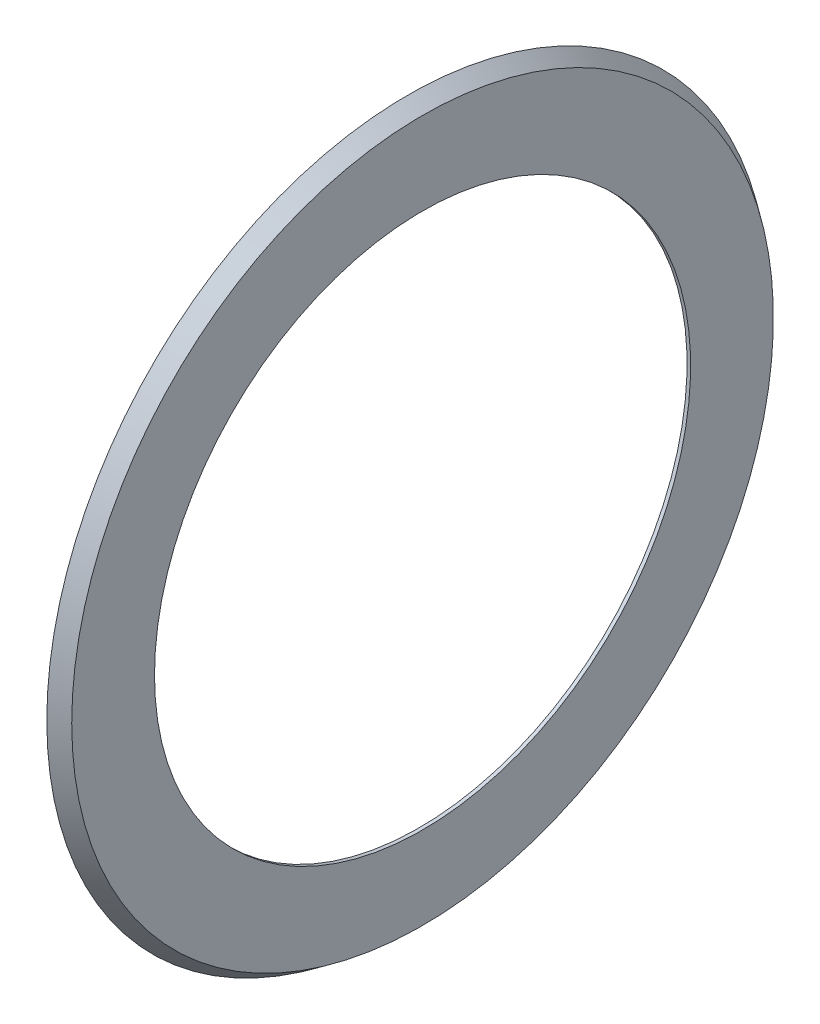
ISO-10303-21;
HEADER;
FILE_DESCRIPTION(('STEP AP214'),'2;1');
FILE_NAME('part.step','',(''),(''),'','','');
FILE_SCHEMA(('AUTOMOTIVE_DESIGN { 1 0 10303 214 1 1 1 1 }'));
ENDSEC;
DATA;
#1=APPLICATION_CONTEXT('core data for automotive mechanical design processes');
#2=APPLICATION_PROTOCOL_DEFINITION('international standard','automotive_design',2000,#1);
#3=PRODUCT_CONTEXT('',#1,'mechanical');
#4=PRODUCT('Part','Part','',(#3));
#5=PRODUCT_RELATED_PRODUCT_CATEGORY('part','',(#4));
#6=PRODUCT_DEFINITION_FORMATION('','',#4);
#7=PRODUCT_DEFINITION_CONTEXT('part definition',#1,'design');
#8=PRODUCT_DEFINITION('design','',#6,#7);
#9=PRODUCT_DEFINITION_SHAPE('','',#8);
#10=(LENGTH_UNIT() NAMED_UNIT(*) SI_UNIT(.MILLI.,.METRE.));
#11=(NAMED_UNIT(*) PLANE_ANGLE_UNIT() SI_UNIT($,.RADIAN.));
#12=(NAMED_UNIT(*) SI_UNIT($,.STERADIAN.) SOLID_ANGLE_UNIT());
#13=UNCERTAINTY_MEASURE_WITH_UNIT(LENGTH_MEASURE(1.E-05),#10,'distance_accuracy_value','');
#14=(GEOMETRIC_REPRESENTATION_CONTEXT(3) GLOBAL_UNCERTAINTY_ASSIGNED_CONTEXT((#13)) GLOBAL_UNIT_ASSIGNED_CONTEXT((#10,
#11,#12)) REPRESENTATION_CONTEXT('',''));
#15=CARTESIAN_POINT('',(0.,0.,0.));
#16=DIRECTION('',(0.,0.,1.));
#17=DIRECTION('',(1.,0.,0.));
#18=AXIS2_PLACEMENT_3D('',#15,#16,#17);
#19=CARTESIAN_POINT('',(9.38451527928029,0.,0.));
#20=DIRECTION('',(1.,0.,0.));
#21=DIRECTION('',(0.,0.,-1.));
#22=AXIS2_PLACEMENT_3D('',#19,#20,#21);
#23=CONICAL_SURFACE('',#22,15.16,1.0471975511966);
#24=CARTESIAN_POINT('',(9.,0.,0.));
#25=DIRECTION('',(-1.,0.,0.));
#26=DIRECTION('',(0.,0.,1.));
#27=AXIS2_PLACEMENT_3D('',#24,#25,#26);
#28=CIRCLE('',#27,14.494);
#29=CARTESIAN_POINT('',(9.,0.,14.494));
#30=VERTEX_POINT('',#29);
#31=EDGE_CURVE('E10',#30,#30,#28,.T.);
#32=ORIENTED_EDGE('',*,*,#31,.F.);
#33=EDGE_LOOP('',(#32));
#34=FACE_BOUND('',#33,.T.);
#35=CARTESIAN_POINT('',(9.38451527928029,0.,0.));
#36=DIRECTION('',(-1.,0.,0.));
#37=DIRECTION('',(0.,0.,1.));
#38=AXIS2_PLACEMENT_3D('',#35,#36,#37);
#39=CIRCLE('',#38,15.16);
#40=CARTESIAN_POINT('',(9.38451527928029,0.,15.16));
#41=VERTEX_POINT('',#40);
#42=EDGE_CURVE('E54',#41,#41,#39,.T.);
#43=ORIENTED_EDGE('',*,*,#42,.T.);
#44=EDGE_LOOP('',(#43));
#45=FACE_BOUND('',#44,.T.);
#46=ADVANCED_FACE('F32',(#34,#45),#23,.T.);
#47=CARTESIAN_POINT('',(9.,0.,0.));
#48=DIRECTION('',(-1.,0.,0.));
#49=DIRECTION('',(0.,0.,1.));
#50=AXIS2_PLACEMENT_3D('',#47,#48,#49);
#51=CONICAL_SURFACE('',#50,14.494,0.610865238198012);
#52=CARTESIAN_POINT('',(9.85,0.,0.));
#53=DIRECTION('',(-1.,0.,0.));
#54=DIRECTION('',(0.,0.,1.));
#55=AXIS2_PLACEMENT_3D('',#52,#53,#54);
#56=CIRCLE('',#55,13.8988235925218);
#57=CARTESIAN_POINT('',(9.85,0.,13.8988235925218));
#58=VERTEX_POINT('',#57);
#59=EDGE_CURVE('E38',#58,#58,#56,.T.);
#60=ORIENTED_EDGE('',*,*,#59,.F.);
#61=EDGE_LOOP('',(#60));
#62=FACE_BOUND('',#61,.T.);
#63=ORIENTED_EDGE('',*,*,#31,.T.);
#64=EDGE_LOOP('',(#63));
#65=FACE_BOUND('',#64,.T.);
#66=ADVANCED_FACE('F79',(#62,#65),#51,.F.);
#67=CARTESIAN_POINT('',(9.85,13.8988235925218,0.));
#68=DIRECTION('',(1.,0.,0.));
#69=DIRECTION('',(0.,0.,-1.));
#70=AXIS2_PLACEMENT_3D('',#67,#68,#69);
#71=PLANE('',#70);
#72=CARTESIAN_POINT('',(9.85,0.,0.));
#73=DIRECTION('',(-1.,0.,0.));
#74=DIRECTION('',(0.,0.,1.));
#75=AXIS2_PLACEMENT_3D('',#72,#73,#74);
#76=CIRCLE('',#75,11.254);
#77=CARTESIAN_POINT('',(9.85,0.,11.254));
#78=VERTEX_POINT('',#77);
#79=EDGE_CURVE('E42',#78,#78,#76,.T.);
#80=ORIENTED_EDGE('',*,*,#79,.F.);
#81=EDGE_LOOP('',(#80));
#82=FACE_BOUND('',#81,.T.);
#83=ORIENTED_EDGE('',*,*,#59,.T.);
#84=EDGE_LOOP('',(#83));
#85=FACE_BOUND('',#84,.T.);
#86=ADVANCED_FACE('F74',(#82,#85),#71,.F.);
#87=CARTESIAN_POINT('',(10.,0.,0.));
#88=DIRECTION('',(-1.,0.,0.));
#89=DIRECTION('',(0.,0.,1.));
#90=AXIS2_PLACEMENT_3D('',#87,#88,#89);
#91=CYLINDRICAL_SURFACE('',#90,11.254);
#92=CARTESIAN_POINT('',(10.,0.,0.));
#93=DIRECTION('',(-1.,0.,0.));
#94=DIRECTION('',(0.,0.,1.));
#95=AXIS2_PLACEMENT_3D('',#92,#93,#94);
#96=CIRCLE('',#95,11.254);
#97=CARTESIAN_POINT('',(10.,0.,11.254));
#98=VERTEX_POINT('',#97);
#99=EDGE_CURVE('E46',#98,#98,#96,.T.);
#100=ORIENTED_EDGE('',*,*,#99,.F.);
#101=EDGE_LOOP('',(#100));
#102=FACE_BOUND('',#101,.T.);
#103=ORIENTED_EDGE('',*,*,#79,.T.);
#104=EDGE_LOOP('',(#103));
#105=FACE_BOUND('',#104,.T.);
#106=ADVANCED_FACE('F68',(#102,#105),#91,.F.);
#107=CARTESIAN_POINT('',(10.,11.254,0.));
#108=DIRECTION('',(-1.,0.,0.));
#109=DIRECTION('',(0.,0.,1.));
#110=AXIS2_PLACEMENT_3D('',#107,#108,#109);
#111=PLANE('',#110);
#112=CARTESIAN_POINT('',(10.,0.,0.));
#113=DIRECTION('',(-1.,0.,0.));
#114=DIRECTION('',(0.,0.,1.));
#115=AXIS2_PLACEMENT_3D('',#112,#113,#114);
#116=CIRCLE('',#115,14.7290329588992);
#117=CARTESIAN_POINT('',(10.,0.,14.7290329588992));
#118=VERTEX_POINT('',#117);
#119=EDGE_CURVE('E51',#118,#118,#116,.T.);
#120=ORIENTED_EDGE('',*,*,#119,.F.);
#121=EDGE_LOOP('',(#120));
#122=FACE_BOUND('',#121,.T.);
#123=ORIENTED_EDGE('',*,*,#99,.T.);
#124=EDGE_LOOP('',(#123));
#125=FACE_BOUND('',#124,.T.);
#126=ADVANCED_FACE('F62',(#122,#125),#111,.F.);
#127=CARTESIAN_POINT('',(10.,0.,0.));
#128=DIRECTION('',(-1.,0.,0.));
#129=DIRECTION('',(0.,0.,1.));
#130=AXIS2_PLACEMENT_3D('',#127,#128,#129);
#131=CONICAL_SURFACE('',#130,14.7290329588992,0.610865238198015);
#132=ORIENTED_EDGE('',*,*,#42,.F.);
#133=EDGE_LOOP('',(#132));
#134=FACE_BOUND('',#133,.T.);
#135=ORIENTED_EDGE('',*,*,#119,.T.);
#136=EDGE_LOOP('',(#135));
#137=FACE_BOUND('',#136,.T.);
#138=ADVANCED_FACE('F59',(#134,#137),#131,.T.);
#139=CLOSED_SHELL('',(#46,#66,#86,#106,#126,#138));
#140=MANIFOLD_SOLID_BREP('B2',#139);
#141=ADVANCED_BREP_SHAPE_REPRESENTATION('',(#18,#140),#14);
#142=SHAPE_DEFINITION_REPRESENTATION(#9,#141);
ENDSEC;
END-ISO-10303-21;
